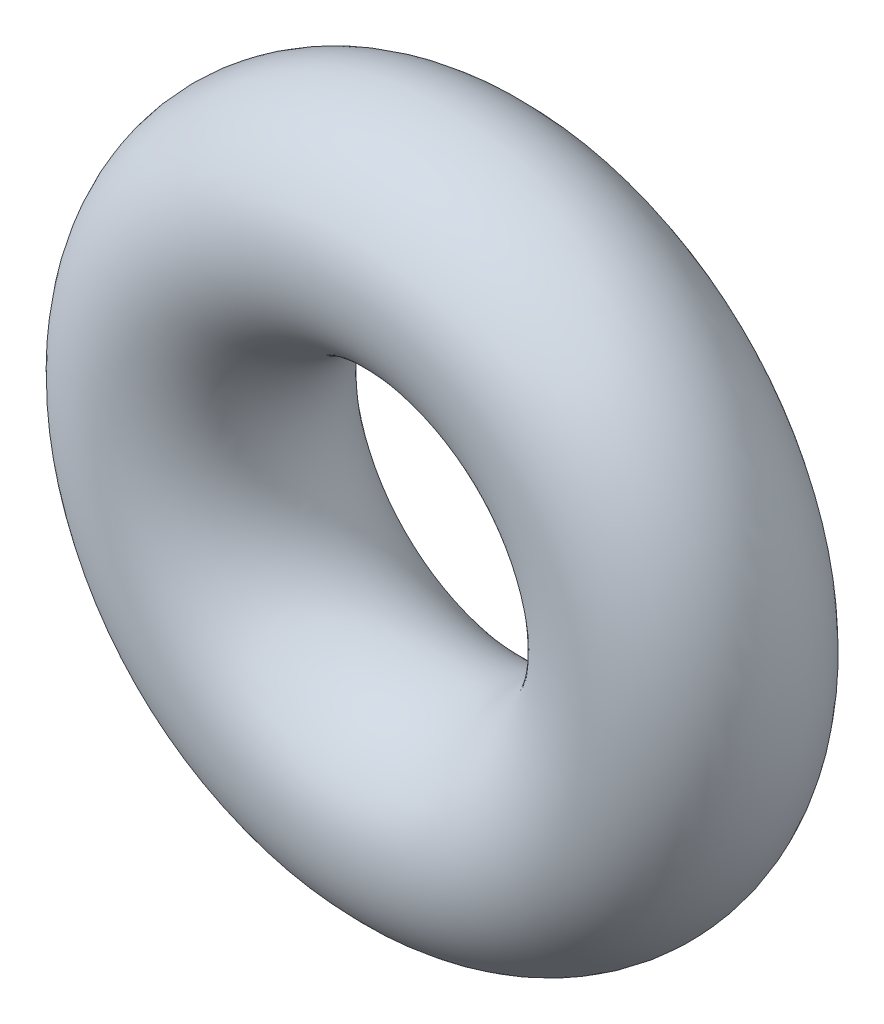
ISO-10303-21;
HEADER;
FILE_DESCRIPTION(('STEP AP214'),'2;1');
FILE_NAME('part.step','',(''),(''),'','','');
FILE_SCHEMA(('AUTOMOTIVE_DESIGN { 1 0 10303 214 1 1 1 1 }'));
ENDSEC;
DATA;
#1=APPLICATION_CONTEXT('core data for automotive mechanical design processes');
#2=APPLICATION_PROTOCOL_DEFINITION('international standard','automotive_design',2000,#1);
#3=PRODUCT_CONTEXT('',#1,'mechanical');
#4=PRODUCT('Part','Part','',(#3));
#5=PRODUCT_RELATED_PRODUCT_CATEGORY('part','',(#4));
#6=PRODUCT_DEFINITION_FORMATION('','',#4);
#7=PRODUCT_DEFINITION_CONTEXT('part definition',#1,'design');
#8=PRODUCT_DEFINITION('design','',#6,#7);
#9=PRODUCT_DEFINITION_SHAPE('','',#8);
#10=(LENGTH_UNIT() NAMED_UNIT(*) SI_UNIT(.MILLI.,.METRE.));
#11=(NAMED_UNIT(*) PLANE_ANGLE_UNIT() SI_UNIT($,.RADIAN.));
#12=(NAMED_UNIT(*) SI_UNIT($,.STERADIAN.) SOLID_ANGLE_UNIT());
#13=UNCERTAINTY_MEASURE_WITH_UNIT(LENGTH_MEASURE(1.E-05),#10,'distance_accuracy_value','');
#14=(GEOMETRIC_REPRESENTATION_CONTEXT(3) GLOBAL_UNCERTAINTY_ASSIGNED_CONTEXT((#13)) GLOBAL_UNIT_ASSIGNED_CONTEXT((#10,
#11,#12)) REPRESENTATION_CONTEXT('',''));
#15=CARTESIAN_POINT('',(0.,0.,0.));
#16=DIRECTION('',(0.,0.,1.));
#17=DIRECTION('',(1.,0.,0.));
#18=AXIS2_PLACEMENT_3D('',#15,#16,#17);
#19=CARTESIAN_POINT('',(0.,0.,5.));
#20=DIRECTION('',(0.,0.,-0.999999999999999));
#21=DIRECTION('',(-1.,0.,0.));
#22=AXIS2_PLACEMENT_3D('',#19,#20,#21);
#23=TOROIDAL_SURFACE('',#22,11.0000000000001,5.);
#24=CARTESIAN_POINT('',(-16.0000000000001,0.,5.));
#25=VERTEX_POINT('',#24);
#26=VERTEX_LOOP('',#25);
#27=FACE_BOUND('',#26,.T.);
#28=ADVANCED_FACE('F23',(#27),#23,.T.);
#29=CLOSED_SHELL('',(#28));
#30=MANIFOLD_SOLID_BREP('B2',#29);
#31=ADVANCED_BREP_SHAPE_REPRESENTATION('',(#18,#30),#14);
#32=SHAPE_DEFINITION_REPRESENTATION(#9,#31);
ENDSEC;
END-ISO-10303-21;
